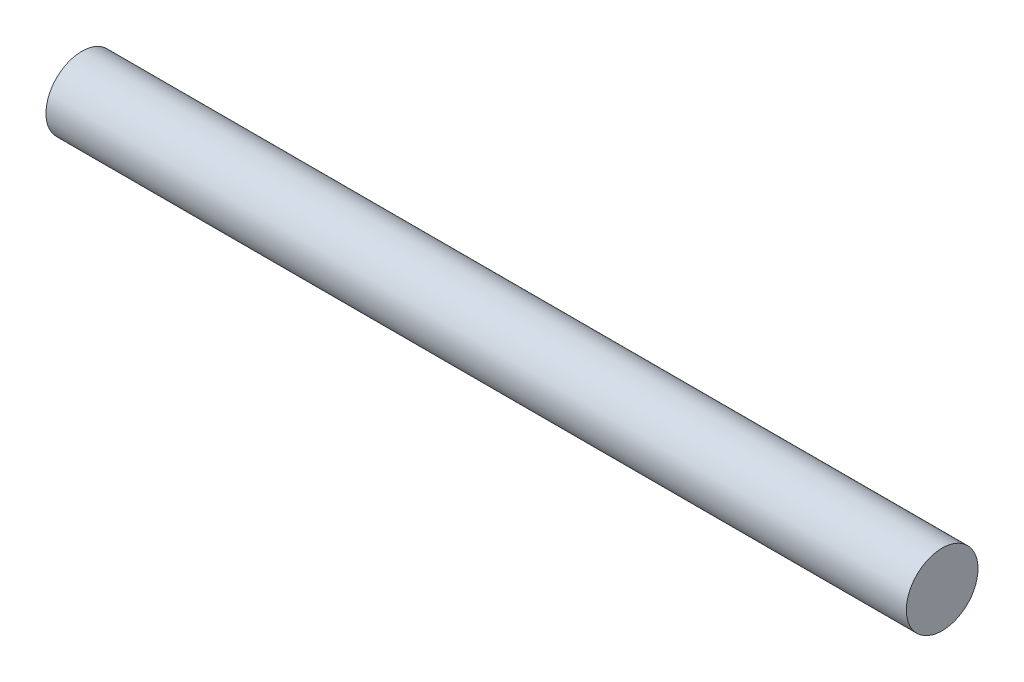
ISO-10303-21;
HEADER;
FILE_DESCRIPTION(('STEP AP214'),'2;1');
FILE_NAME('part.step','',(''),(''),'','','');
FILE_SCHEMA(('AUTOMOTIVE_DESIGN { 1 0 10303 214 1 1 1 1 }'));
ENDSEC;
DATA;
#1=APPLICATION_CONTEXT('core data for automotive mechanical design processes');
#2=APPLICATION_PROTOCOL_DEFINITION('international standard','automotive_design',2000,#1);
#3=PRODUCT_CONTEXT('',#1,'mechanical');
#4=PRODUCT('Part','Part','',(#3));
#5=PRODUCT_RELATED_PRODUCT_CATEGORY('part','',(#4));
#6=PRODUCT_DEFINITION_FORMATION('','',#4);
#7=PRODUCT_DEFINITION_CONTEXT('part definition',#1,'design');
#8=PRODUCT_DEFINITION('design','',#6,#7);
#9=PRODUCT_DEFINITION_SHAPE('','',#8);
#10=(LENGTH_UNIT() NAMED_UNIT(*) SI_UNIT(.MILLI.,.METRE.));
#11=(NAMED_UNIT(*) PLANE_ANGLE_UNIT() SI_UNIT($,.RADIAN.));
#12=(NAMED_UNIT(*) SI_UNIT($,.STERADIAN.) SOLID_ANGLE_UNIT());
#13=UNCERTAINTY_MEASURE_WITH_UNIT(LENGTH_MEASURE(1.E-05),#10,'distance_accuracy_value','');
#14=(GEOMETRIC_REPRESENTATION_CONTEXT(3) GLOBAL_UNCERTAINTY_ASSIGNED_CONTEXT((#13)) GLOBAL_UNIT_ASSIGNED_CONTEXT((#10,
#11,#12)) REPRESENTATION_CONTEXT('',''));
#15=CARTESIAN_POINT('',(0.,0.,0.));
#16=DIRECTION('',(0.,0.,1.));
#17=DIRECTION('',(1.,0.,0.));
#18=AXIS2_PLACEMENT_3D('',#15,#16,#17);
#19=CARTESIAN_POINT('',(72.,0.,0.));
#20=DIRECTION('',(-1.,0.,0.));
#21=DIRECTION('',(0.,0.,1.));
#22=AXIS2_PLACEMENT_3D('',#19,#20,#21);
#23=CYLINDRICAL_SURFACE('',#22,3.);
#24=CARTESIAN_POINT('',(72.,0.,0.));
#25=DIRECTION('',(1.,0.,0.));
#26=DIRECTION('',(0.,0.,-1.));
#27=AXIS2_PLACEMENT_3D('',#24,#25,#26);
#28=CIRCLE('',#27,3.);
#29=CARTESIAN_POINT('',(72.,0.,-3.));
#30=VERTEX_POINT('',#29);
#31=EDGE_CURVE('E10',#30,#30,#28,.T.);
#32=ORIENTED_EDGE('',*,*,#31,.F.);
#33=EDGE_LOOP('',(#32));
#34=FACE_BOUND('',#33,.T.);
#35=CARTESIAN_POINT('',(0.,0.,0.));
#36=DIRECTION('',(1.,0.,0.));
#37=DIRECTION('',(0.,0.,-1.));
#38=AXIS2_PLACEMENT_3D('',#35,#36,#37);
#39=CIRCLE('',#38,3.);
#40=CARTESIAN_POINT('',(0.,0.,-3.));
#41=VERTEX_POINT('',#40);
#42=EDGE_CURVE('E40',#41,#41,#39,.T.);
#43=ORIENTED_EDGE('',*,*,#42,.T.);
#44=EDGE_LOOP('',(#43));
#45=FACE_BOUND('',#44,.T.);
#46=ADVANCED_FACE('F37',(#34,#45),#23,.T.);
#47=CARTESIAN_POINT('',(72.,0.,0.));
#48=DIRECTION('',(1.,0.,0.));
#49=DIRECTION('',(0.,0.,-1.));
#50=AXIS2_PLACEMENT_3D('',#47,#48,#49);
#51=PLANE('',#50);
#52=ORIENTED_EDGE('',*,*,#31,.T.);
#53=EDGE_LOOP('',(#52));
#54=FACE_BOUND('',#53,.T.);
#55=ADVANCED_FACE('F52',(#54),#51,.T.);
#56=CARTESIAN_POINT('',(0.,0.,0.));
#57=DIRECTION('',(1.,0.,0.));
#58=DIRECTION('',(0.,0.,-1.));
#59=AXIS2_PLACEMENT_3D('',#56,#57,#58);
#60=PLANE('',#59);
#61=ORIENTED_EDGE('',*,*,#42,.F.);
#62=EDGE_LOOP('',(#61));
#63=FACE_BOUND('',#62,.T.);
#64=ADVANCED_FACE('F50',(#63),#60,.F.);
#65=CLOSED_SHELL('',(#46,#55,#64));
#66=MANIFOLD_SOLID_BREP('B2',#65);
#67=ADVANCED_BREP_SHAPE_REPRESENTATION('',(#18,#66),#14);
#68=SHAPE_DEFINITION_REPRESENTATION(#9,#67);
ENDSEC;
END-ISO-10303-21;
